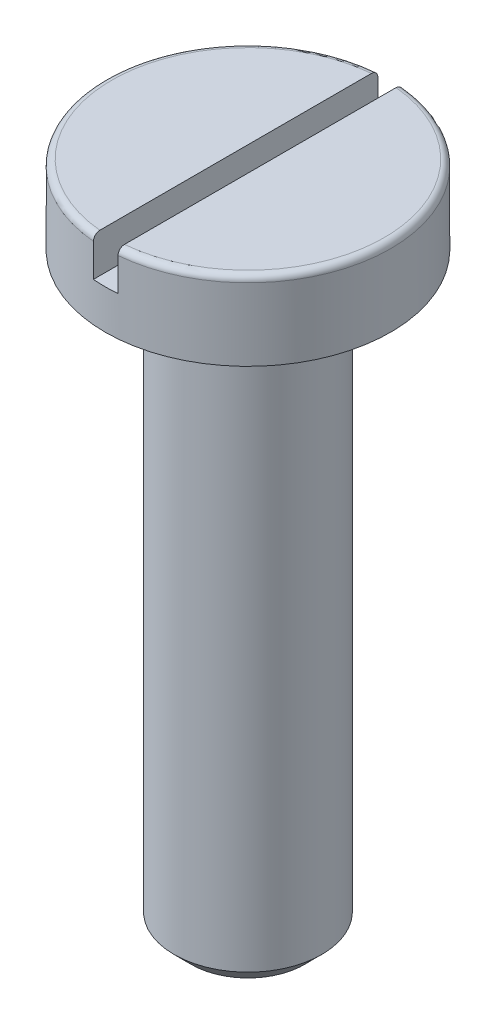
ISO-10303-21;
HEADER;
FILE_DESCRIPTION(('STEP AP214'),'2;1');
FILE_NAME('part.step','',(''),(''),'','','');
FILE_SCHEMA(('AUTOMOTIVE_DESIGN { 1 0 10303 214 1 1 1 1 }'));
ENDSEC;
DATA;
#1=APPLICATION_CONTEXT('core data for automotive mechanical design processes');
#2=APPLICATION_PROTOCOL_DEFINITION('international standard','automotive_design',2000,#1);
#3=PRODUCT_CONTEXT('',#1,'mechanical');
#4=PRODUCT('Part','Part','',(#3));
#5=PRODUCT_RELATED_PRODUCT_CATEGORY('part','',(#4));
#6=PRODUCT_DEFINITION_FORMATION('','',#4);
#7=PRODUCT_DEFINITION_CONTEXT('part definition',#1,'design');
#8=PRODUCT_DEFINITION('design','',#6,#7);
#9=PRODUCT_DEFINITION_SHAPE('','',#8);
#10=(LENGTH_UNIT() NAMED_UNIT(*) SI_UNIT(.MILLI.,.METRE.));
#11=(NAMED_UNIT(*) PLANE_ANGLE_UNIT() SI_UNIT($,.RADIAN.));
#12=(NAMED_UNIT(*) SI_UNIT($,.STERADIAN.) SOLID_ANGLE_UNIT());
#13=UNCERTAINTY_MEASURE_WITH_UNIT(LENGTH_MEASURE(1.E-05),#10,'distance_accuracy_value','');
#14=(GEOMETRIC_REPRESENTATION_CONTEXT(3) GLOBAL_UNCERTAINTY_ASSIGNED_CONTEXT((#13)) GLOBAL_UNIT_ASSIGNED_CONTEXT((#10,
#11,#12)) REPRESENTATION_CONTEXT('',''));
#15=CARTESIAN_POINT('',(0.,0.,0.));
#16=DIRECTION('',(0.,0.,1.));
#17=DIRECTION('',(1.,0.,0.));
#18=AXIS2_PLACEMENT_3D('',#15,#16,#17);
#19=CARTESIAN_POINT('',(0.,1.6,0.));
#20=DIRECTION('',(0.,-1.,0.));
#21=DIRECTION('',(0.,0.,-1.));
#22=AXIS2_PLACEMENT_3D('',#19,#20,#21);
#23=PLANE('',#22);
#24=CARTESIAN_POINT('',(0.,1.6,0.));
#25=DIRECTION('',(0.,1.,0.));
#26=DIRECTION('',(0.,0.,1.));
#27=AXIS2_PLACEMENT_3D('',#24,#25,#26);
#28=CIRCLE('',#27,2.77);
#29=CARTESIAN_POINT('',(-0.25,1.6,-2.75869534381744));
#30=VERTEX_POINT('',#29);
#31=CARTESIAN_POINT('',(-0.25,1.6,2.75869534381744));
#32=VERTEX_POINT('',#31);
#33=EDGE_CURVE('E96',#30,#32,#28,.T.);
#34=ORIENTED_EDGE('',*,*,#33,.T.);
#35=DIRECTION('',(0.,0.,1.));
#36=VECTOR('',#35,1.);
#37=CARTESIAN_POINT('',(-0.25,1.6,-2.9));
#38=LINE('',#37,#36);
#39=EDGE_CURVE('E87',#30,#32,#38,.T.);
#40=ORIENTED_EDGE('',*,*,#39,.F.);
#41=EDGE_LOOP('',(#34,#40));
#42=FACE_BOUND('',#41,.T.);
#43=ADVANCED_FACE('F33',(#42),#23,.F.);
#44=CARTESIAN_POINT('',(0.,1.47,0.));
#45=DIRECTION('',(0.,1.,0.));
#46=DIRECTION('',(0.,0.,1.));
#47=AXIS2_PLACEMENT_3D('',#44,#45,#46);
#48=TOROIDAL_SURFACE('',#47,2.77,0.13);
#49=ORIENTED_EDGE('',*,*,#33,.F.);
#50=CARTESIAN_POINT('',(-0.25,1.54312910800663,-2.86660008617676));
#51=CARTESIAN_POINT('',(-0.25,1.53711294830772,-2.87070858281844));
#52=CARTESIAN_POINT('',(-0.25,1.53074624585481,-2.87431298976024));
#53=CARTESIAN_POINT('',(-0.25,1.51749299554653,-2.88040507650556));
#54=CARTESIAN_POINT('',(-0.25,1.51060585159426,-2.88289145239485));
#55=CARTESIAN_POINT('',(-0.25,1.49651364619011,-2.88667077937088));
#56=CARTESIAN_POINT('',(-0.25,1.48930870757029,-2.88796418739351));
#57=CARTESIAN_POINT('',(-0.25,1.47478583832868,-2.88932087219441));
#58=CARTESIAN_POINT('',(-0.25,1.46746793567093,-2.88938444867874));
#59=CARTESIAN_POINT('',(-0.25,1.45293403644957,-2.8882811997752));
#60=CARTESIAN_POINT('',(-0.25,1.44571793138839,-2.88711580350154));
#61=CARTESIAN_POINT('',(-0.25,1.43158343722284,-2.88359050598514));
#62=CARTESIAN_POINT('',(-0.25,1.42466505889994,-2.88123056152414));
#63=CARTESIAN_POINT('',(-0.25,1.41131907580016,-2.87538309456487));
#64=CARTESIAN_POINT('',(-0.25,1.40489167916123,-2.87189509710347));
#65=CARTESIAN_POINT('',(-0.25,1.39271174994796,-2.86389214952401));
#66=CARTESIAN_POINT('',(-0.25,1.38695922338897,-2.85937719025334));
#67=CARTESIAN_POINT('',(-0.25,1.37627619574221,-2.84943666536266));
#68=CARTESIAN_POINT('',(-0.25,1.37134782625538,-2.84400880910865));
#69=CARTESIAN_POINT('',(-0.25,1.36246828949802,-2.83240536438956));
#70=CARTESIAN_POINT('',(-0.25,1.35851713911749,-2.82622976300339));
#71=CARTESIAN_POINT('',(-0.25,1.35168868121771,-2.81328178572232));
#72=CARTESIAN_POINT('',(-0.25,1.34881538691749,-2.80650729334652));
#73=CARTESIAN_POINT('',(-0.25,1.34424259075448,-2.79257309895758));
#74=CARTESIAN_POINT('',(-0.25,1.34254311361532,-2.78541338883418));
#75=CARTESIAN_POINT('',(-0.25,1.34036090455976,-2.77088620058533));
#76=CARTESIAN_POINT('',(-0.25,1.33988228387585,-2.76351810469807));
#77=CARTESIAN_POINT('',(-0.25,1.34016668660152,-2.74880587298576));
#78=CARTESIAN_POINT('',(-0.25,1.34092972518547,-2.74146173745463));
#79=CARTESIAN_POINT('',(-0.25,1.34367835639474,-2.72699381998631));
#80=CARTESIAN_POINT('',(-0.25,1.34566587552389,-2.71987040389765));
#81=CARTESIAN_POINT('',(-0.25,1.35080982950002,-2.70605883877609));
#82=CARTESIAN_POINT('',(-0.25,1.35396626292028,-2.69937068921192));
#83=CARTESIAN_POINT('',(-0.25,1.36135597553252,-2.68662772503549));
#84=CARTESIAN_POINT('',(-0.25,1.36558811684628,-2.68057225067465));
#85=CARTESIAN_POINT('',(-0.25,1.37501217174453,-2.669260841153));
#86=CARTESIAN_POINT('',(-0.25,1.38020406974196,-2.66400489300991));
#87=CARTESIAN_POINT('',(-0.25,1.39138176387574,-2.65446131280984));
#88=CARTESIAN_POINT('',(-0.25,1.39736480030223,-2.6501704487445));
#89=CARTESIAN_POINT('',(-0.25,1.40996883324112,-2.64265916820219));
#90=CARTESIAN_POINT('',(-0.25,1.41658981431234,-2.63943872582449));
#91=CARTESIAN_POINT('',(-0.25,1.43025138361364,-2.63417400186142));
#92=CARTESIAN_POINT('',(-0.25,1.43729005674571,-2.63212475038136));
#93=CARTESIAN_POINT('',(-0.25,1.45161198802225,-2.62924116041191));
#94=CARTESIAN_POINT('',(-0.25,1.45889524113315,-2.62840679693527));
#95=CARTESIAN_POINT('',(-0.25,1.47347542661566,-2.62797811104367));
#96=CARTESIAN_POINT('',(-0.25,1.48077224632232,-2.62837994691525));
#97=CARTESIAN_POINT('',(-0.25,1.49519466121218,-2.63040351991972));
#98=CARTESIAN_POINT('',(-0.25,1.50232025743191,-2.63202524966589));
#99=CARTESIAN_POINT('',(-0.25,1.51619554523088,-2.63644047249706));
#100=CARTESIAN_POINT('',(-0.25,1.52294537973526,-2.63923351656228));
#101=CARTESIAN_POINT('',(-0.25,1.53588196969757,-2.64591040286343));
#102=CARTESIAN_POINT('',(-0.25,1.54206871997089,-2.64979425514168));
#103=CARTESIAN_POINT('',(-0.25,1.55372078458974,-2.65855221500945));
#104=CARTESIAN_POINT('',(-0.25,1.55918424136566,-2.66342879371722));
#105=CARTESIAN_POINT('',(-0.25,1.56921910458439,-2.67402657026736));
#106=CARTESIAN_POINT('',(-0.25,1.5737904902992,-2.67974778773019));
#107=CARTESIAN_POINT('',(-0.25,1.58193168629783,-2.69189783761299));
#108=CARTESIAN_POINT('',(-0.25,1.5854972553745,-2.69832951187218));
#109=CARTESIAN_POINT('',(-0.25,1.59150274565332,-2.71169852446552));
#110=CARTESIAN_POINT('',(-0.25,1.59394263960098,-2.71863587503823));
#111=CARTESIAN_POINT('',(-0.25,1.59763652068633,-2.73284780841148));
#112=CARTESIAN_POINT('',(-0.25,1.59888594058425,-2.74012357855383));
#113=CARTESIAN_POINT('',(-0.25,1.60014789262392,-2.75478137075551));
#114=CARTESIAN_POINT('',(-0.25,1.60016045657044,-2.76216339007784));
#115=CARTESIAN_POINT('',(-0.25,1.59894723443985,-2.77683733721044));
#116=CARTESIAN_POINT('',(-0.25,1.59771939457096,-2.78412909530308));
#117=CARTESIAN_POINT('',(-0.25,1.59405541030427,-2.79840462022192));
#118=CARTESIAN_POINT('',(-0.25,1.59161896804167,-2.80538831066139));
#119=CARTESIAN_POINT('',(-0.25,1.58560742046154,-2.81884276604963));
#120=CARTESIAN_POINT('',(-0.25,1.58203280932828,-2.82531375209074));
#121=CARTESIAN_POINT('',(-0.25,1.57384692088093,-2.83755525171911));
#122=CARTESIAN_POINT('',(-0.25,1.56923690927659,-2.84332660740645));
#123=CARTESIAN_POINT('',(-0.25,1.560999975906,-2.852017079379));
#124=CARTESIAN_POINT('',(-0.25,1.5576452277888,-2.85519860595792));
#125=CARTESIAN_POINT('',(-0.25,1.55061699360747,-2.8611876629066));
#126=CARTESIAN_POINT('',(-0.25,1.54694350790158,-2.86399519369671));
#127=CARTESIAN_POINT('',(-0.25,1.54312910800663,-2.86660008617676));
#128=B_SPLINE_CURVE_WITH_KNOTS('',3,(#50,#51,#52,#53,#54,#55,#56,#57,#58,#59,#60,#61,#62,#63,
#64,#65,#66,#67,#68,#69,#70,#71,#72,#73,#74,#75,#76,#77,#78,#79,#80,#81,#82,#83,#84,#85,#86,#87,
#88,#89,#90,#91,#92,#93,#94,#95,#96,#97,#98,#99,#100,#101,#102,#103,#104,#105,#106,#107,#108,
#109,#110,#111,#112,#113,#114,#115,#116,#117,#118,#119,#120,#121,#122,#123,#124,#125,#126,#127),
.UNSPECIFIED.,.T.,.F.,(4,2,2,2,2,2,2,2,2,2,2,2,2,2,2,2,2,2,2,2,2,2,2,2,2,2,2,2,2,2,2,2,2,2,2,2,
2,2,4),(0.,0.0218387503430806,0.0437029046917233,0.0655586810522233,0.0874091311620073,
0.109234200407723,0.131060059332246,0.152895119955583,0.174730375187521,0.196621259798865,
0.218512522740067,0.240484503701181,0.262456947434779,0.284503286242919,0.306549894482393,
0.328631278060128,0.350712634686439,0.372770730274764,0.394828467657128,0.416811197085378,
0.438793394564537,0.460681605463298,0.48256936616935,0.50438917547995,0.526208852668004,
0.548020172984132,0.569831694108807,0.591698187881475,0.613565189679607,0.635523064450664,
0.657481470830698,0.679523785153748,0.701565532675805,0.723643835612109,0.745727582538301,
0.767801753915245,0.789849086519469,0.803695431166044,0.81754176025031),.UNSPECIFIED.);
#129=CARTESIAN_POINT('',(-0.25,1.47,-2.88920404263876));
#130=VERTEX_POINT('',#129);
#131=EDGE_CURVE('E84',#30,#130,#128,.T.);
#132=ORIENTED_EDGE('',*,*,#131,.T.);
#133=CARTESIAN_POINT('',(0.,1.47,0.));
#134=DIRECTION('',(0.,1.,0.));
#135=DIRECTION('',(0.,0.,1.));
#136=AXIS2_PLACEMENT_3D('',#133,#134,#135);
#137=CIRCLE('',#136,2.9);
#138=CARTESIAN_POINT('',(-0.25,1.46999999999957,2.88920404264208));
#139=VERTEX_POINT('',#138);
#140=EDGE_CURVE('E103',#130,#139,#137,.T.);
#141=ORIENTED_EDGE('',*,*,#140,.T.);
#142=CARTESIAN_POINT('',(-0.25,1.51508458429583,2.63624066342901));
#143=CARTESIAN_POINT('',(-0.25,1.50826683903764,2.63370882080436));
#144=CARTESIAN_POINT('',(-0.25,1.50123065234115,2.63175022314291));
#145=CARTESIAN_POINT('',(-0.25,1.48692355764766,2.629040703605));
#146=CARTESIAN_POINT('',(-0.25,1.47965238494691,2.62829119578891));
#147=CARTESIAN_POINT('',(-0.25,1.46509003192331,2.62802469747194));
#148=CARTESIAN_POINT('',(-0.25,1.45779886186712,2.62850716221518));
#149=CARTESIAN_POINT('',(-0.25,1.44340306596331,2.63068950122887));
#150=CARTESIAN_POINT('',(-0.25,1.43629839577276,2.63238908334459));
#151=CARTESIAN_POINT('',(-0.25,1.42247481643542,2.63695570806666));
#152=CARTESIAN_POINT('',(-0.25,1.41575590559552,2.63982274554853));
#153=CARTESIAN_POINT('',(-0.25,1.40289281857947,2.64664142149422));
#154=CARTESIAN_POINT('',(-0.25,1.39674866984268,2.65059311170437));
#155=CARTESIAN_POINT('',(-0.25,1.38519223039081,2.65947903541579));
#156=CARTESIAN_POINT('',(-0.25,1.37978187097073,2.6644157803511));
#157=CARTESIAN_POINT('',(-0.25,1.36986250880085,2.67512413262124));
#158=CARTESIAN_POINT('',(-0.25,1.36535352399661,2.68089575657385));
#159=CARTESIAN_POINT('',(-0.25,1.35734483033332,2.69313583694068));
#160=CARTESIAN_POINT('',(-0.25,1.35384941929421,2.69960710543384));
#161=CARTESIAN_POINT('',(-0.25,1.34798994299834,2.7130430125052));
#162=CARTESIAN_POINT('',(-0.25,1.34562590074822,2.7200076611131));
#163=CARTESIAN_POINT('',(-0.25,1.34208772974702,2.7342607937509));
#164=CARTESIAN_POINT('',(-0.25,1.34091810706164,2.74155039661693));
#165=CARTESIAN_POINT('',(-0.25,1.33981698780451,2.75622257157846));
#166=CARTESIAN_POINT('',(-0.25,1.33988550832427,2.76360514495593));
#167=CARTESIAN_POINT('',(-0.25,1.3412602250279,2.77826674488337));
#168=CARTESIAN_POINT('',(-0.25,1.34256849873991,2.78554557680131));
#169=CARTESIAN_POINT('',(-0.25,1.34638967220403,2.79977992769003));
#170=CARTESIAN_POINT('',(-0.25,1.34890256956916,2.80673544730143));
#171=CARTESIAN_POINT('',(-0.25,1.35506001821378,2.82011782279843));
#172=CARTESIAN_POINT('',(-0.25,1.35870344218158,2.82654519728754));
#173=CARTESIAN_POINT('',(-0.25,1.36702079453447,2.83869454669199));
#174=CARTESIAN_POINT('',(-0.25,1.37169470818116,2.84441653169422));
#175=CARTESIAN_POINT('',(-0.25,1.38192534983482,2.85497355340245));
#176=CARTESIAN_POINT('',(-0.25,1.38747932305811,2.85981125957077));
#177=CARTESIAN_POINT('',(-0.25,1.39932323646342,2.86848134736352));
#178=CARTESIAN_POINT('',(-0.25,1.40561316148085,2.8723137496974));
#179=CARTESIAN_POINT('',(-0.25,1.41872500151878,2.87884934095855));
#180=CARTESIAN_POINT('',(-0.25,1.42554482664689,2.88155672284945));
#181=CARTESIAN_POINT('',(-0.25,1.43954300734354,2.88578431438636));
#182=CARTESIAN_POINT('',(-0.25,1.44672135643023,2.88730454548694));
#183=CARTESIAN_POINT('',(-0.25,1.46121039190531,2.88911090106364));
#184=CARTESIAN_POINT('',(-0.25,1.46852063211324,2.88940060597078));
#185=CARTESIAN_POINT('',(-0.25,1.48308577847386,2.8887473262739));
#186=CARTESIAN_POINT('',(-0.25,1.49034068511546,2.88780435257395));
#187=CARTESIAN_POINT('',(-0.25,1.50458219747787,2.88471458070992));
#188=CARTESIAN_POINT('',(-0.25,1.5115690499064,2.88256891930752));
#189=CARTESIAN_POINT('',(-0.25,1.52508407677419,2.87713661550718));
#190=CARTESIAN_POINT('',(-0.25,1.53161224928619,2.8738499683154));
#191=CARTESIAN_POINT('',(-0.25,1.54403468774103,2.86622498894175));
#192=CARTESIAN_POINT('',(-0.25,1.54992807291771,2.86188522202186));
#193=CARTESIAN_POINT('',(-0.25,1.56090550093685,2.85228075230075));
#194=CARTESIAN_POINT('',(-0.25,1.56598953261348,2.84701603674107));
#195=CARTESIAN_POINT('',(-0.25,1.57522144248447,2.83569355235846));
#196=CARTESIAN_POINT('',(-0.25,1.57936630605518,2.8296333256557));
#197=CARTESIAN_POINT('',(-0.25,1.58658422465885,2.8169050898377));
#198=CARTESIAN_POINT('',(-0.25,1.58965725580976,2.81023706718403));
#199=CARTESIAN_POINT('',(-0.25,1.59465619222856,2.79645576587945));
#200=CARTESIAN_POINT('',(-0.25,1.59657776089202,2.78934091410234));
#201=CARTESIAN_POINT('',(-0.25,1.59920285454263,2.77488991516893));
#202=CARTESIAN_POINT('',(-0.25,1.59990635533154,2.76755376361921));
#203=CARTESIAN_POINT('',(-0.25,1.6000763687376,2.75284646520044));
#204=CARTESIAN_POINT('',(-0.25,1.59953940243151,2.74547527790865));
#205=CARTESIAN_POINT('',(-0.25,1.59723636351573,2.73092770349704));
#206=CARTESIAN_POINT('',(-0.25,1.59547032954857,2.72375131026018));
#207=CARTESIAN_POINT('',(-0.25,1.59075732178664,2.70979378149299));
#208=CARTESIAN_POINT('',(-0.25,1.58780982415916,2.70301282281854));
#209=CARTESIAN_POINT('',(-0.25,1.58081499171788,2.69004163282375));
#210=CARTESIAN_POINT('',(-0.25,1.57676739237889,2.68385154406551));
#211=CARTESIAN_POINT('',(-0.25,1.56769463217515,2.67225212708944));
#212=CARTESIAN_POINT('',(-0.25,1.56267108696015,2.66684153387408));
#213=CARTESIAN_POINT('',(-0.25,1.55178722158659,2.65695006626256));
#214=CARTESIAN_POINT('',(-0.25,1.54592793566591,2.65246805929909));
#215=CARTESIAN_POINT('',(-0.25,1.53586022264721,2.64603954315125));
#216=CARTESIAN_POINT('',(-0.25,1.53185325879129,2.64377147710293));
#217=CARTESIAN_POINT('',(-0.25,1.5236215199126,2.6396727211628));
#218=CARTESIAN_POINT('',(-0.25,1.51939674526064,2.63784203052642));
#219=CARTESIAN_POINT('',(-0.25,1.51508458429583,2.63624066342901));
#220=B_SPLINE_CURVE_WITH_KNOTS('',3,(#142,#143,#144,#145,#146,#147,#148,#149,#150,#151,#152,
#153,#154,#155,#156,#157,#158,#159,#160,#161,#162,#163,#164,#165,#166,#167,#168,#169,#170,#171,
#172,#173,#174,#175,#176,#177,#178,#179,#180,#181,#182,#183,#184,#185,#186,#187,#188,#189,#190,
#191,#192,#193,#194,#195,#196,#197,#198,#199,#200,#201,#202,#203,#204,#205,#206,#207,#208,#209,
#210,#211,#212,#213,#214,#215,#216,#217,#218,#219),.UNSPECIFIED.,.T.,.F.,(4,2,2,2,2,2,2,2,2,2,2,
2,2,2,2,2,2,2,2,2,2,2,2,2,2,2,2,2,2,2,2,2,2,2,2,2,2,2,4),(0.,0.0218012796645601,
0.0436280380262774,0.0654451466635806,0.08725702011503,0.109068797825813,0.130881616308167,
0.1527507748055,0.174620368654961,0.196581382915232,0.218542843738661,0.240586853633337,
0.262631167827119,0.284712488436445,0.306793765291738,0.328853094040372,0.35091210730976,
0.372903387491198,0.394894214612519,0.416802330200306,0.438710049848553,0.460553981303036,
0.482397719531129,0.504220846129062,0.52604406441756,0.547897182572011,0.569750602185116,
0.591673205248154,0.613596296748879,0.635601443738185,0.657607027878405,0.679674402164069,
0.701741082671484,0.723817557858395,0.745899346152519,0.767944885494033,0.789963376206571,
0.803752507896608,0.817541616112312),.UNSPECIFIED.);
#221=EDGE_CURVE('E93',#139,#32,#220,.T.);
#222=ORIENTED_EDGE('',*,*,#221,.T.);
#223=EDGE_LOOP('',(#49,#132,#141,#222));
#224=FACE_BOUND('',#223,.T.);
#225=ADVANCED_FACE('F99',(#224),#48,.T.);
#226=CARTESIAN_POINT('',(0.,-12.,0.));
#227=DIRECTION('',(0.,1.,0.));
#228=DIRECTION('',(0.,0.,1.));
#229=AXIS2_PLACEMENT_3D('',#226,#227,#228);
#230=CYLINDRICAL_SURFACE('',#229,1.5);
#231=CARTESIAN_POINT('',(0.,-11.65,0.));
#232=DIRECTION('',(0.,1.,0.));
#233=DIRECTION('',(0.,0.,1.));
#234=AXIS2_PLACEMENT_3D('',#231,#232,#233);
#235=CIRCLE('',#234,1.5);
#236=CARTESIAN_POINT('',(0.,-11.65,1.5));
#237=VERTEX_POINT('',#236);
#238=EDGE_CURVE('E116',#237,#237,#235,.T.);
#239=ORIENTED_EDGE('',*,*,#238,.T.);
#240=EDGE_LOOP('',(#239));
#241=FACE_BOUND('',#240,.T.);
#242=CARTESIAN_POINT('',(0.,0.,0.));
#243=DIRECTION('',(0.,1.,0.));
#244=DIRECTION('',(0.,0.,1.));
#245=AXIS2_PLACEMENT_3D('',#242,#243,#244);
#246=CIRCLE('',#245,1.5);
#247=CARTESIAN_POINT('',(0.,0.,1.5));
#248=VERTEX_POINT('',#247);
#249=EDGE_CURVE('E113',#248,#248,#246,.T.);
#250=ORIENTED_EDGE('',*,*,#249,.F.);
#251=EDGE_LOOP('',(#250));
#252=FACE_BOUND('',#251,.T.);
#253=ADVANCED_FACE('F184',(#241,#252),#230,.T.);
#254=CARTESIAN_POINT('',(0.,-12.,0.));
#255=DIRECTION('',(0.,1.,0.));
#256=DIRECTION('',(0.,0.,1.));
#257=AXIS2_PLACEMENT_3D('',#254,#255,#256);
#258=PLANE('',#257);
#259=CARTESIAN_POINT('',(0.,-12.,0.));
#260=DIRECTION('',(0.,1.,0.));
#261=DIRECTION('',(0.,0.,1.));
#262=AXIS2_PLACEMENT_3D('',#259,#260,#261);
#263=CIRCLE('',#262,1.15);
#264=CARTESIAN_POINT('',(0.,-12.,1.15));
#265=VERTEX_POINT('',#264);
#266=EDGE_CURVE('E119',#265,#265,#263,.F.);
#267=ORIENTED_EDGE('',*,*,#266,.T.);
#268=EDGE_LOOP('',(#267));
#269=FACE_BOUND('',#268,.T.);
#270=ADVANCED_FACE('F194',(#269),#258,.F.);
#271=CARTESIAN_POINT('',(0.,-11.65,0.));
#272=DIRECTION('',(0.,1.,0.));
#273=DIRECTION('',(0.,0.,1.));
#274=AXIS2_PLACEMENT_3D('',#271,#272,#273);
#275=CONICAL_SURFACE('',#274,1.5,0.785398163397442);
#276=ORIENTED_EDGE('',*,*,#266,.F.);
#277=EDGE_LOOP('',(#276));
#278=FACE_BOUND('',#277,.T.);
#279=ORIENTED_EDGE('',*,*,#238,.F.);
#280=EDGE_LOOP('',(#279));
#281=FACE_BOUND('',#280,.T.);
#282=ADVANCED_FACE('F35',(#278,#281),#275,.T.);
#283=CARTESIAN_POINT('',(0.25,1.6,2.75869534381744));
#284=VERTEX_POINT('',#283);
#285=CARTESIAN_POINT('',(0.25,1.6,-2.75869534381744));
#286=VERTEX_POINT('',#285);
#287=EDGE_CURVE('E100',#284,#286,#28,.T.);
#288=ORIENTED_EDGE('',*,*,#287,.T.);
#289=DIRECTION('',(0.,0.,-1.));
#290=VECTOR('',#289,1.);
#291=CARTESIAN_POINT('',(0.25,1.6,-2.9));
#292=LINE('',#291,#290);
#293=EDGE_CURVE('E97',#284,#286,#292,.T.);
#294=ORIENTED_EDGE('',*,*,#293,.F.);
#295=EDGE_LOOP('',(#288,#294));
#296=FACE_BOUND('',#295,.T.);
#297=ADVANCED_FACE('F158',(#296),#23,.F.);
#298=CARTESIAN_POINT('',(0.,0.,0.));
#299=DIRECTION('',(0.,1.,0.));
#300=DIRECTION('',(0.,0.,1.));
#301=AXIS2_PLACEMENT_3D('',#298,#299,#300);
#302=PLANE('',#301);
#303=ORIENTED_EDGE('',*,*,#249,.T.);
#304=EDGE_LOOP('',(#303));
#305=FACE_BOUND('',#304,.T.);
#306=CARTESIAN_POINT('',(0.,0.,0.));
#307=DIRECTION('',(0.,1.,0.));
#308=DIRECTION('',(0.,0.,1.));
#309=AXIS2_PLACEMENT_3D('',#306,#307,#308);
#310=CIRCLE('',#309,2.9);
#311=CARTESIAN_POINT('',(0.,0.,2.9));
#312=VERTEX_POINT('',#311);
#313=EDGE_CURVE('E110',#312,#312,#310,.T.);
#314=ORIENTED_EDGE('',*,*,#313,.F.);
#315=EDGE_LOOP('',(#314));
#316=FACE_BOUND('',#315,.T.);
#317=ADVANCED_FACE('F188',(#305,#316),#302,.F.);
#318=CARTESIAN_POINT('',(0.,1.3,0.));
#319=DIRECTION('',(0.,1.,0.));
#320=DIRECTION('',(0.,0.,1.));
#321=AXIS2_PLACEMENT_3D('',#318,#319,#320);
#322=CYLINDRICAL_SURFACE('',#321,2.9);
#323=ORIENTED_EDGE('',*,*,#140,.F.);
#324=DIRECTION('',(0.,1.,0.));
#325=VECTOR('',#324,1.);
#326=CARTESIAN_POINT('',(-0.25,1.3,-2.88920404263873));
#327=LINE('',#326,#325);
#328=CARTESIAN_POINT('',(-0.25,0.8,-2.88920404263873));
#329=VERTEX_POINT('',#328);
#330=EDGE_CURVE('E56',#130,#329,#327,.F.);
#331=ORIENTED_EDGE('',*,*,#330,.T.);
#332=CARTESIAN_POINT('',(0.,0.8,0.));
#333=DIRECTION('',(0.,1.,0.));
#334=DIRECTION('',(0.,0.,1.));
#335=AXIS2_PLACEMENT_3D('',#332,#333,#334);
#336=CIRCLE('',#335,2.9);
#337=CARTESIAN_POINT('',(0.25,0.8,-2.88920404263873));
#338=VERTEX_POINT('',#337);
#339=EDGE_CURVE('E11',#338,#329,#336,.T.);
#340=ORIENTED_EDGE('',*,*,#339,.F.);
#341=DIRECTION('',(0.,1.,0.));
#342=VECTOR('',#341,1.);
#343=CARTESIAN_POINT('',(0.25,1.3,-2.88920404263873));
#344=LINE('',#343,#342);
#345=CARTESIAN_POINT('',(0.25,1.47,-2.88920404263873));
#346=VERTEX_POINT('',#345);
#347=EDGE_CURVE('E167',#338,#346,#344,.T.);
#348=ORIENTED_EDGE('',*,*,#347,.T.);
#349=CARTESIAN_POINT('',(0.25,1.47,2.88920404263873));
#350=VERTEX_POINT('',#349);
#351=EDGE_CURVE('E109',#350,#346,#137,.T.);
#352=ORIENTED_EDGE('',*,*,#351,.F.);
#353=DIRECTION('',(0.,1.,0.));
#354=VECTOR('',#353,1.);
#355=CARTESIAN_POINT('',(0.25,1.3,2.88920404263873));
#356=LINE('',#355,#354);
#357=CARTESIAN_POINT('',(0.25,0.8,2.88920404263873));
#358=VERTEX_POINT('',#357);
#359=EDGE_CURVE('E48',#350,#358,#356,.F.);
#360=ORIENTED_EDGE('',*,*,#359,.T.);
#361=CARTESIAN_POINT('',(-0.25,0.8,2.88920404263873));
#362=VERTEX_POINT('',#361);
#363=EDGE_CURVE('E37',#362,#358,#336,.T.);
#364=ORIENTED_EDGE('',*,*,#363,.F.);
#365=DIRECTION('',(0.,1.,0.));
#366=VECTOR('',#365,1.);
#367=CARTESIAN_POINT('',(-0.25,1.3,2.88920404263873));
#368=LINE('',#367,#366);
#369=EDGE_CURVE('E104',#362,#139,#368,.T.);
#370=ORIENTED_EDGE('',*,*,#369,.T.);
#371=EDGE_LOOP('',(#323,#331,#340,#348,#352,#360,#364,#370));
#372=FACE_BOUND('',#371,.T.);
#373=ORIENTED_EDGE('',*,*,#313,.T.);
#374=EDGE_LOOP('',(#373));
#375=FACE_BOUND('',#374,.T.);
#376=ADVANCED_FACE('F171',(#372,#375),#322,.T.);
#377=ORIENTED_EDGE('',*,*,#351,.T.);
#378=CARTESIAN_POINT('',(0.25,1.54312910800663,-2.86660008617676));
#379=CARTESIAN_POINT('',(0.25,1.5491745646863,-2.86247079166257));
#380=CARTESIAN_POINT('',(0.25,1.55487479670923,-2.85782639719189));
#381=CARTESIAN_POINT('',(0.25,1.56541834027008,-2.84764165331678));
#382=CARTESIAN_POINT('',(0.25,1.5702605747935,-2.84210019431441));
#383=CARTESIAN_POINT('',(0.25,1.57894407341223,-2.83028661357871));
#384=CARTESIAN_POINT('',(0.25,1.58278597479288,-2.82401496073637));
#385=CARTESIAN_POINT('',(0.25,1.58936447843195,-2.81091882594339));
#386=CARTESIAN_POINT('',(0.25,1.59210135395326,-2.80409448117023));
#387=CARTESIAN_POINT('',(0.25,1.5964020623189,-2.790064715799));
#388=CARTESIAN_POINT('',(0.25,1.59796259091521,-2.78285828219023));
#389=CARTESIAN_POINT('',(0.25,1.59985507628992,-2.76828554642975));
#390=CARTESIAN_POINT('',(0.25,1.60018696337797,-2.7609192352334));
#391=CARTESIAN_POINT('',(0.25,1.59961237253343,-2.7462165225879));
#392=CARTESIAN_POINT('',(0.25,1.59870279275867,-2.73888024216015));
#393=CARTESIAN_POINT('',(0.25,1.5956651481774,-2.72446438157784));
#394=CARTESIAN_POINT('',(0.25,1.59353707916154,-2.71738480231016));
#395=CARTESIAN_POINT('',(0.25,1.5881212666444,-2.70368272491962));
#396=CARTESIAN_POINT('',(0.25,1.58483335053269,-2.697060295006));
#397=CARTESIAN_POINT('',(0.25,1.5771897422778,-2.68446326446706));
#398=CARTESIAN_POINT('',(0.25,1.5728340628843,-2.6784886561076));
#399=CARTESIAN_POINT('',(0.25,1.56318940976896,-2.66737336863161));
#400=CARTESIAN_POINT('',(0.25,1.55790277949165,-2.66223065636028));
#401=CARTESIAN_POINT('',(0.25,1.54653803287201,-2.6529102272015));
#402=CARTESIAN_POINT('',(0.25,1.54045993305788,-2.64873249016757));
#403=CARTESIAN_POINT('',(0.25,1.52771160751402,-2.64147908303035));
#404=CARTESIAN_POINT('',(0.25,1.52104393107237,-2.6383989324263));
#405=CARTESIAN_POINT('',(0.25,1.50728476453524,-2.63340672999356));
#406=CARTESIAN_POINT('',(0.25,1.50019328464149,-2.63149465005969));
#407=CARTESIAN_POINT('',(0.25,1.48581726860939,-2.62889978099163));
#408=CARTESIAN_POINT('',(0.25,1.47853358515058,-2.62821226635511));
#409=CARTESIAN_POINT('',(0.25,1.46395439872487,-2.62807213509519));
#410=CARTESIAN_POINT('',(0.25,1.45665889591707,-2.62861950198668));
#411=CARTESIAN_POINT('',(0.25,1.44227612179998,-2.63093109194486));
#412=CARTESIAN_POINT('',(0.25,1.43518851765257,-2.63269324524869));
#413=CARTESIAN_POINT('',(0.25,1.42140916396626,-2.63738092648));
#414=CARTESIAN_POINT('',(0.25,1.41471741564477,-2.64030645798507));
#415=CARTESIAN_POINT('',(0.25,1.40190964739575,-2.64724085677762));
#416=CARTESIAN_POINT('',(0.25,1.3957943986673,-2.65125114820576));
#417=CARTESIAN_POINT('',(0.25,1.38432079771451,-2.66023796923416));
#418=CARTESIAN_POINT('',(0.25,1.37896245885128,-2.66521451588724));
#419=CARTESIAN_POINT('',(0.25,1.36913350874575,-2.67601176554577));
#420=CARTESIAN_POINT('',(0.25,1.36466621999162,-2.68183549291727));
#421=CARTESIAN_POINT('',(0.25,1.35676790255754,-2.69414768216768));
#422=CARTESIAN_POINT('',(0.25,1.35333689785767,-2.70063615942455));
#423=CARTESIAN_POINT('',(0.25,1.34759368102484,-2.71412303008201));
#424=CARTESIAN_POINT('',(0.25,1.34528623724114,-2.72112345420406));
#425=CARTESIAN_POINT('',(0.25,1.34187564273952,-2.73541179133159));
#426=CARTESIAN_POINT('',(0.25,1.34077251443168,-2.74269970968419));
#427=CARTESIAN_POINT('',(0.25,1.33979982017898,-2.75737809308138));
#428=CARTESIAN_POINT('',(0.25,1.33993373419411,-2.7647687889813));
#429=CARTESIAN_POINT('',(0.25,1.34144003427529,-2.77942292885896));
#430=CARTESIAN_POINT('',(0.25,1.3428124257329,-2.78668637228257));
#431=CARTESIAN_POINT('',(0.25,1.34675838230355,-2.80088148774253));
#432=CARTESIAN_POINT('',(0.25,1.3493322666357,-2.80781307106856));
#433=CARTESIAN_POINT('',(0.25,1.3556097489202,-2.82114436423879));
#434=CARTESIAN_POINT('',(0.25,1.35931333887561,-2.82754407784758));
#435=CARTESIAN_POINT('',(0.25,1.36773694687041,-2.83961421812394));
#436=CARTESIAN_POINT('',(0.25,1.37245468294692,-2.84528623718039));
#437=CARTESIAN_POINT('',(0.25,1.38277860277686,-2.85575413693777));
#438=CARTESIAN_POINT('',(0.25,1.38838477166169,-2.86055003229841));
#439=CARTESIAN_POINT('',(0.25,1.40030477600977,-2.86911096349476));
#440=CARTESIAN_POINT('',(0.25,1.40661598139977,-2.87287966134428));
#441=CARTESIAN_POINT('',(0.25,1.41978296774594,-2.87929953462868));
#442=CARTESIAN_POINT('',(0.25,1.42663871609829,-2.88195077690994));
#443=CARTESIAN_POINT('',(0.25,1.44067384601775,-2.88605130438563));
#444=CARTESIAN_POINT('',(0.25,1.447851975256,-2.88750487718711));
#445=CARTESIAN_POINT('',(0.25,1.46235242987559,-2.88918389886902));
#446=CARTESIAN_POINT('',(0.25,1.46967478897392,-2.88940905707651));
#447=CARTESIAN_POINT('',(0.25,1.48424138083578,-2.88862494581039));
#448=CARTESIAN_POINT('',(0.25,1.49148571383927,-2.8876175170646));
#449=CARTESIAN_POINT('',(0.25,1.50569606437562,-2.88440083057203));
#450=CARTESIAN_POINT('',(0.25,1.51266240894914,-2.88219303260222));
#451=CARTESIAN_POINT('',(0.25,1.52355590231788,-2.87770261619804));
#452=CARTESIAN_POINT('',(0.25,1.52763032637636,-2.87576853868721));
#453=CARTESIAN_POINT('',(0.25,1.53555646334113,-2.87148804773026));
#454=CARTESIAN_POINT('',(0.25,1.53940817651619,-2.86914163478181));
#455=CARTESIAN_POINT('',(0.25,1.54312910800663,-2.86660008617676));
#456=B_SPLINE_CURVE_WITH_KNOTS('',3,(#378,#379,#380,#381,#382,#383,#384,#385,#386,#387,#388,
#389,#390,#391,#392,#393,#394,#395,#396,#397,#398,#399,#400,#401,#402,#403,#404,#405,#406,#407,
#408,#409,#410,#411,#412,#413,#414,#415,#416,#417,#418,#419,#420,#421,#422,#423,#424,#425,#426,
#427,#428,#429,#430,#431,#432,#433,#434,#435,#436,#437,#438,#439,#440,#441,#442,#443,#444,#445,
#446,#447,#448,#449,#450,#451,#452,#453,#454,#455),.UNSPECIFIED.,.T.,.F.,(4,2,2,2,2,2,2,2,2,2,2,
2,2,2,2,2,2,2,2,2,2,2,2,2,2,2,2,2,2,2,2,2,2,2,2,2,2,2,4),(0.,0.0219467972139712,
0.0439209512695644,0.065881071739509,0.0878357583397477,0.109851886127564,0.131869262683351,
0.153941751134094,0.17601431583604,0.198090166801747,0.220165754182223,0.242186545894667,
0.264206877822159,0.286136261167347,0.308065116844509,0.329909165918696,0.351752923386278,
0.373559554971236,0.395366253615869,0.417201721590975,0.439037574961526,0.460953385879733,
0.482869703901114,0.504878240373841,0.526887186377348,0.548958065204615,0.571029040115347,
0.593105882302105,0.615182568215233,0.637210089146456,0.659237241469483,0.681184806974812,
0.703131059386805,0.724998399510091,0.74687091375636,0.768710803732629,0.79052419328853,
0.804032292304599,0.817540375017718),.UNSPECIFIED.);
#457=EDGE_CURVE('E128',#346,#286,#456,.T.);
#458=ORIENTED_EDGE('',*,*,#457,.T.);
#459=ORIENTED_EDGE('',*,*,#287,.F.);
#460=CARTESIAN_POINT('',(0.25,1.51508458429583,2.63624066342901));
#461=CARTESIAN_POINT('',(0.25,1.52193089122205,2.63878381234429));
#462=CARTESIAN_POINT('',(0.25,1.52856686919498,2.64190877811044));
#463=CARTESIAN_POINT('',(0.25,1.54122460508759,2.64923246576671));
#464=CARTESIAN_POINT('',(0.25,1.54724559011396,2.65343251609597));
#465=CARTESIAN_POINT('',(0.25,1.55849414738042,2.66278069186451));
#466=CARTESIAN_POINT('',(0.25,1.56372223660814,2.66792819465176));
#467=CARTESIAN_POINT('',(0.25,1.57324175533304,2.67902397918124));
#468=CARTESIAN_POINT('',(0.25,1.57753341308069,2.68497206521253));
#469=CARTESIAN_POINT('',(0.25,1.58507533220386,2.69752141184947));
#470=CARTESIAN_POINT('',(0.25,1.5883222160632,2.70412470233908));
#471=CARTESIAN_POINT('',(0.25,1.59366598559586,2.71778157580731));
#472=CARTESIAN_POINT('',(0.25,1.59576280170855,2.72483518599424));
#473=CARTESIAN_POINT('',(0.25,1.59875370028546,2.73921932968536));
#474=CARTESIAN_POINT('',(0.25,1.5996434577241,2.74655076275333));
#475=CARTESIAN_POINT('',(0.25,1.60018139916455,2.76125907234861));
#476=CARTESIAN_POINT('',(0.25,1.59982957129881,2.76863594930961));
#477=CARTESIAN_POINT('',(0.25,1.5978924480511,2.78323641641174));
#478=CARTESIAN_POINT('',(0.25,1.59630544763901,2.79045978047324));
#479=CARTESIAN_POINT('',(0.25,1.59193975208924,2.80453698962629));
#480=CARTESIAN_POINT('',(0.25,1.58916106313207,2.81139083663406));
#481=CARTESIAN_POINT('',(0.25,1.58249371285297,2.82452456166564));
#482=CARTESIAN_POINT('',(0.25,1.57860647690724,2.83080516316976));
#483=CARTESIAN_POINT('',(0.25,1.56982953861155,2.84262186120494));
#484=CARTESIAN_POINT('',(0.25,1.56493985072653,2.8481579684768));
#485=CARTESIAN_POINT('',(0.25,1.55431343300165,2.85830913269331));
#486=CARTESIAN_POINT('',(0.25,1.54857948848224,2.86292710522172));
#487=CARTESIAN_POINT('',(0.25,1.53641526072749,2.87113055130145));
#488=CARTESIAN_POINT('',(0.25,1.52998499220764,2.87471604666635));
#489=CARTESIAN_POINT('',(0.25,1.51663650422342,2.8807388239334));
#490=CARTESIAN_POINT('',(0.25,1.5097201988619,2.88318034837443));
#491=CARTESIAN_POINT('',(0.25,1.49557525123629,2.886864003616));
#492=CARTESIAN_POINT('',(0.25,1.48834661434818,2.88810615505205));
#493=CARTESIAN_POINT('',(0.25,1.47380335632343,2.88935317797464));
#494=CARTESIAN_POINT('',(0.25,1.46648902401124,2.88936142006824));
#495=CARTESIAN_POINT('',(0.25,1.45196300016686,2.88814886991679));
#496=CARTESIAN_POINT('',(0.25,1.44475130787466,2.88692808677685));
#497=CARTESIAN_POINT('',(0.25,1.43064019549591,2.88329416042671));
#498=CARTESIAN_POINT('',(0.25,1.42374056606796,2.88088182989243));
#499=CARTESIAN_POINT('',(0.25,1.4104433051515,2.87493487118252));
#500=CARTESIAN_POINT('',(0.25,1.40404567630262,2.87140023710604));
#501=CARTESIAN_POINT('',(0.25,1.39192244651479,2.86330365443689));
#502=CARTESIAN_POINT('',(0.25,1.38619794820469,2.85874005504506));
#503=CARTESIAN_POINT('',(0.25,1.37559322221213,2.84871945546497));
#504=CARTESIAN_POINT('',(0.25,1.37071300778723,2.84326244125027));
#505=CARTESIAN_POINT('',(0.25,1.36191791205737,2.83159084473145));
#506=CARTESIAN_POINT('',(0.25,1.3580062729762,2.8253738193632));
#507=CARTESIAN_POINT('',(0.25,1.35127777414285,2.81237318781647));
#508=CARTESIAN_POINT('',(0.25,1.34846093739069,2.80558956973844));
#509=CARTESIAN_POINT('',(0.25,1.34399128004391,2.79162128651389));
#510=CARTESIAN_POINT('',(0.25,1.34234282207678,2.78443522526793));
#511=CARTESIAN_POINT('',(0.25,1.3402722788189,2.7698885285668));
#512=CARTESIAN_POINT('',(0.25,1.3398502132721,2.76252789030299));
#513=CARTESIAN_POINT('',(0.25,1.3402443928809,2.74782070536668));
#514=CARTESIAN_POINT('',(0.25,1.34106384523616,2.74047424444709));
#515=CARTESIAN_POINT('',(0.25,1.34392409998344,2.72602297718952));
#516=CARTESIAN_POINT('',(0.25,1.34596491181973,2.71891817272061));
#517=CARTESIAN_POINT('',(0.25,1.35121175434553,2.70515060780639));
#518=CARTESIAN_POINT('',(0.25,1.35441806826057,2.69848795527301));
#519=CARTESIAN_POINT('',(0.25,1.36190632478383,2.68579722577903));
#520=CARTESIAN_POINT('',(0.25,1.36618825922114,2.67976914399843));
#521=CARTESIAN_POINT('',(0.25,1.37569606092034,2.6685346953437));
#522=CARTESIAN_POINT('',(0.25,1.38091965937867,2.66332640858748));
#523=CARTESIAN_POINT('',(0.25,1.39217007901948,2.65386532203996));
#524=CARTESIAN_POINT('',(0.25,1.39819685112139,2.64961246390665));
#525=CARTESIAN_POINT('',(0.25,1.41085558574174,2.64220176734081));
#526=CARTESIAN_POINT('',(0.25,1.417484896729,2.63903939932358));
#527=CARTESIAN_POINT('',(0.25,1.43118363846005,2.63387678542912));
#528=CARTESIAN_POINT('',(0.25,1.43825316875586,2.6318768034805));
#529=CARTESIAN_POINT('',(0.25,1.45260291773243,2.62910348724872));
#530=CARTESIAN_POINT('',(0.25,1.4598823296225,2.62832596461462));
#531=CARTESIAN_POINT('',(0.25,1.47446198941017,2.62800827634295));
#532=CARTESIAN_POINT('',(0.25,1.4817622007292,2.62846659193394));
#533=CARTESIAN_POINT('',(0.25,1.49342192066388,2.63019333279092));
#534=CARTESIAN_POINT('',(0.25,1.49784049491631,2.63108585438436));
#535=CARTESIAN_POINT('',(0.25,1.5065609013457,2.63332538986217));
#536=CARTESIAN_POINT('',(0.25,1.51086273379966,2.63467240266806));
#537=CARTESIAN_POINT('',(0.25,1.51508458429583,2.63624066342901));
#538=B_SPLINE_CURVE_WITH_KNOTS('',3,(#460,#461,#462,#463,#464,#465,#466,#467,#468,#469,#470,
#471,#472,#473,#474,#475,#476,#477,#478,#479,#480,#481,#482,#483,#484,#485,#486,#487,#488,#489,
#490,#491,#492,#493,#494,#495,#496,#497,#498,#499,#500,#501,#502,#503,#504,#505,#506,#507,#508,
#509,#510,#511,#512,#513,#514,#515,#516,#517,#518,#519,#520,#521,#522,#523,#524,#525,#526,#527,
#528,#529,#530,#531,#532,#533,#534,#535,#536,#537),.UNSPECIFIED.,.T.,.F.,(4,2,2,2,2,2,2,2,2,2,2,
2,2,2,2,2,2,2,2,2,2,2,2,2,2,2,2,2,2,2,2,2,2,2,2,2,2,2,4),(0.,0.0218936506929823,
0.0438144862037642,0.0657209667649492,0.0876221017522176,0.109593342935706,0.131565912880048,
0.153617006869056,0.175668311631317,0.197750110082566,0.219831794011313,0.241885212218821,
0.263938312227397,0.285920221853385,0.30790166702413,0.32980093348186,0.351699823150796,
0.373538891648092,0.39537779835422,0.417201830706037,0.439025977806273,0.460885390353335,
0.482745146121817,0.504677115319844,0.526609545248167,0.548623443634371,0.570637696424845,
0.592708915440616,0.61478030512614,0.636857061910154,0.658933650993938,0.680957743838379,
0.702980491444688,0.724910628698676,0.746845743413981,0.768705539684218,0.790538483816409,
0.804039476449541,0.81754043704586),.UNSPECIFIED.);
#539=EDGE_CURVE('E122',#284,#350,#538,.T.);
#540=ORIENTED_EDGE('',*,*,#539,.T.);
#541=EDGE_LOOP('',(#377,#458,#459,#540));
#542=FACE_BOUND('',#541,.T.);
#543=ADVANCED_FACE('F132',(#542),#48,.T.);
#544=CARTESIAN_POINT('',(-0.25,0.8,2.9));
#545=DIRECTION('',(0.,1.,0.));
#546=DIRECTION('',(0.,0.,1.));
#547=AXIS2_PLACEMENT_3D('',#544,#545,#546);
#548=PLANE('',#547);
#549=DIRECTION('',(0.,0.,-1.));
#550=VECTOR('',#549,1.);
#551=CARTESIAN_POINT('',(0.25,0.8,-2.9));
#552=LINE('',#551,#550);
#553=EDGE_CURVE('E162',#358,#338,#552,.T.);
#554=ORIENTED_EDGE('',*,*,#553,.T.);
#555=ORIENTED_EDGE('',*,*,#339,.T.);
#556=DIRECTION('',(0.,0.,1.));
#557=VECTOR('',#556,1.);
#558=CARTESIAN_POINT('',(-0.25,0.8,-2.9));
#559=LINE('',#558,#557);
#560=EDGE_CURVE('E159',#329,#362,#559,.T.);
#561=ORIENTED_EDGE('',*,*,#560,.T.);
#562=ORIENTED_EDGE('',*,*,#363,.T.);
#563=EDGE_LOOP('',(#554,#555,#561,#562));
#564=FACE_BOUND('',#563,.T.);
#565=ADVANCED_FACE('F140',(#564),#548,.T.);
#566=CARTESIAN_POINT('',(-0.25,0.8,-2.9));
#567=DIRECTION('',(-1.,0.,0.));
#568=DIRECTION('',(0.,0.,1.));
#569=AXIS2_PLACEMENT_3D('',#566,#567,#568);
#570=PLANE('',#569);
#571=ORIENTED_EDGE('',*,*,#131,.F.);
#572=ORIENTED_EDGE('',*,*,#39,.T.);
#573=ORIENTED_EDGE('',*,*,#221,.F.);
#574=ORIENTED_EDGE('',*,*,#369,.F.);
#575=ORIENTED_EDGE('',*,*,#560,.F.);
#576=ORIENTED_EDGE('',*,*,#330,.F.);
#577=EDGE_LOOP('',(#571,#572,#573,#574,#575,#576));
#578=FACE_BOUND('',#577,.T.);
#579=ADVANCED_FACE('F86',(#578),#570,.F.);
#580=CARTESIAN_POINT('',(0.25,0.8,-2.9));
#581=DIRECTION('',(1.,0.,0.));
#582=DIRECTION('',(0.,0.,-1.));
#583=AXIS2_PLACEMENT_3D('',#580,#581,#582);
#584=PLANE('',#583);
#585=ORIENTED_EDGE('',*,*,#553,.F.);
#586=ORIENTED_EDGE('',*,*,#359,.F.);
#587=ORIENTED_EDGE('',*,*,#539,.F.);
#588=ORIENTED_EDGE('',*,*,#293,.T.);
#589=ORIENTED_EDGE('',*,*,#457,.F.);
#590=ORIENTED_EDGE('',*,*,#347,.F.);
#591=EDGE_LOOP('',(#585,#586,#587,#588,#589,#590));
#592=FACE_BOUND('',#591,.T.);
#593=ADVANCED_FACE('F136',(#592),#584,.F.);
#594=CLOSED_SHELL('',(#43,#225,#253,#270,#282,#297,#317,#376,#543,#565,#579,#593));
#595=MANIFOLD_SOLID_BREP('B2',#594);
#596=ADVANCED_BREP_SHAPE_REPRESENTATION('',(#18,#595),#14);
#597=SHAPE_DEFINITION_REPRESENTATION(#9,#596);
ENDSEC;
END-ISO-10303-21;
